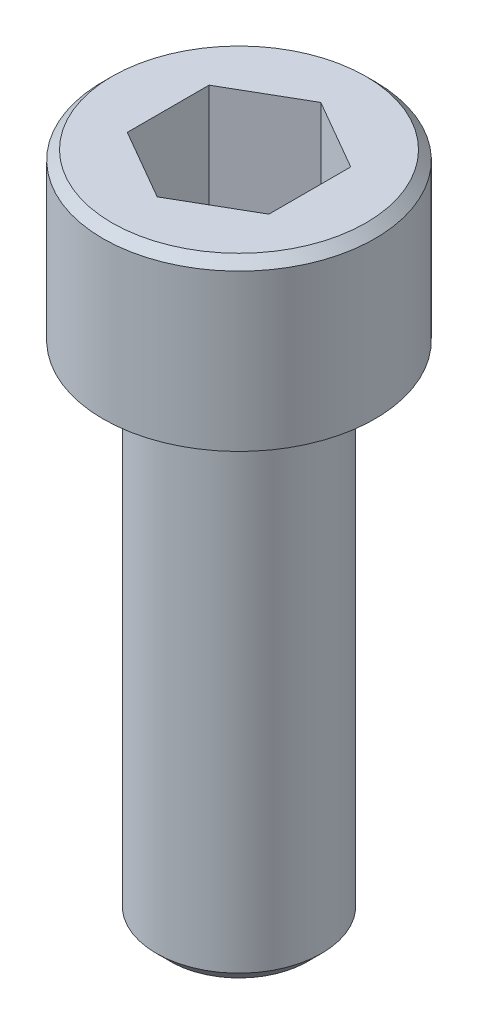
from build123d import *

# Parameters (mm, degrees)
SKETCH1_R           = 3.429
HEAD_DEPTH          = 4.1656
SKETCH2_R           = 2.0828
SHANK_DEPTH         = 12.7
HEX_2_DEPTH         = 3.9116
HEAD_CHAMFER_SIZE   = 0.2286
THREAD_CHAMFER_SIZE = 0.3556
SKETCH4_R           = 0.762
CUT_EXTRUDE1_DEPTH  = 18.548918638


with BuildPart() as part:
    # Sketch1 → Head (new body)
    with BuildSketch(Plane(origin=(0, 0, 0), x_dir=(1, 0, 0), z_dir=(0, 1, 0))):
        with Locations(Location((0, 0, 0), (0, 0, 270))):
            Circle(SKETCH1_R)
    extrude(amount=HEAD_DEPTH)

    # Sketch2 → Shank (add)
    with BuildSketch(Plane.XZ):
        with Locations(Location((0, 0, 0), (0, 0, 90))):
            Circle(SKETCH2_R)
    extrude(amount=SHANK_DEPTH)

    # Sketch3 → Hex 2 (cut)
    with BuildSketch(Plane(origin=(0, 4.1656, 0), x_dir=(-1, 0, 0), z_dir=(0, 1, 0))):
        Polygon((0, 2.062222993), (-1.7859375, 1.031111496), (-1.7859375, -1.031111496), (0, -2.062222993), (1.7859375, -1.031111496), (1.7859375, 1.031111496), align=None)
    extrude(amount=-HEX_2_DEPTH, mode=Mode.SUBTRACT)

    # Head Chamfer
    head_chamfer_edges = [part.edges().sort_by_distance(p)[0] for p in [
        (0, 4.1656, -3.429),
    ]]
    chamfer(head_chamfer_edges, length=HEAD_CHAMFER_SIZE)

    # Thread Chamfer
    thread_chamfer_edges = [part.edges().sort_by_distance(p)[0] for p in [
        (0, -12.7, -2.0828),
    ]]
    chamfer(thread_chamfer_edges, length=THREAD_CHAMFER_SIZE)

    # Sketch4 → Cut-Extrude1 (cut, through all)
    with BuildSketch(Plane.XZ.offset(12.7)):
        with Locations(Location((0, 0, 0), (0, 0, 270))):
            Circle(SKETCH4_R)
    extrude(amount=-CUT_EXTRUDE1_DEPTH, mode=Mode.SUBTRACT)


solid = part.part
